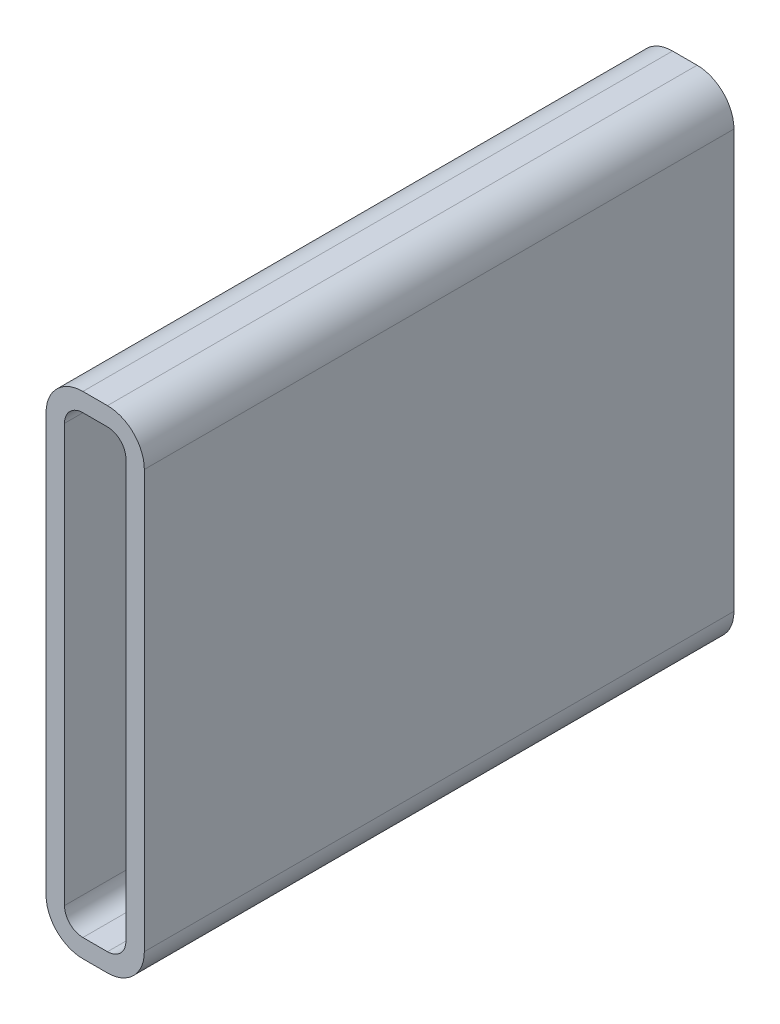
ISO-10303-21;
HEADER;
FILE_DESCRIPTION(('STEP AP214'),'2;1');
FILE_NAME('part.step','',(''),(''),'','','');
FILE_SCHEMA(('AUTOMOTIVE_DESIGN { 1 0 10303 214 1 1 1 1 }'));
ENDSEC;
DATA;
#1=APPLICATION_CONTEXT('core data for automotive mechanical design processes');
#2=APPLICATION_PROTOCOL_DEFINITION('international standard','automotive_design',2000,#1);
#3=PRODUCT_CONTEXT('',#1,'mechanical');
#4=PRODUCT('Part','Part','',(#3));
#5=PRODUCT_RELATED_PRODUCT_CATEGORY('part','',(#4));
#6=PRODUCT_DEFINITION_FORMATION('','',#4);
#7=PRODUCT_DEFINITION_CONTEXT('part definition',#1,'design');
#8=PRODUCT_DEFINITION('design','',#6,#7);
#9=PRODUCT_DEFINITION_SHAPE('','',#8);
#10=(LENGTH_UNIT() NAMED_UNIT(*) SI_UNIT(.MILLI.,.METRE.));
#11=(NAMED_UNIT(*) PLANE_ANGLE_UNIT() SI_UNIT($,.RADIAN.));
#12=(NAMED_UNIT(*) SI_UNIT($,.STERADIAN.) SOLID_ANGLE_UNIT());
#13=UNCERTAINTY_MEASURE_WITH_UNIT(LENGTH_MEASURE(1.E-05),#10,'distance_accuracy_value','');
#14=(GEOMETRIC_REPRESENTATION_CONTEXT(3) GLOBAL_UNCERTAINTY_ASSIGNED_CONTEXT((#13)) GLOBAL_UNIT_ASSIGNED_CONTEXT((#10,
#11,#12)) REPRESENTATION_CONTEXT('',''));
#15=CARTESIAN_POINT('',(0.,0.,0.));
#16=DIRECTION('',(0.,0.,1.));
#17=DIRECTION('',(1.,0.,0.));
#18=AXIS2_PLACEMENT_3D('',#15,#16,#17);
#19=CARTESIAN_POINT('',(19.05,234.95,304.8));
#20=DIRECTION('',(0.,0.,1.));
#21=DIRECTION('',(1.,0.,0.));
#22=AXIS2_PLACEMENT_3D('',#19,#20,#21);
#23=PLANE('',#22);
#24=CARTESIAN_POINT('',(19.05,234.95,304.8));
#25=DIRECTION('',(0.,0.,1.));
#26=DIRECTION('',(1.,0.,0.));
#27=AXIS2_PLACEMENT_3D('',#24,#25,#26);
#28=CIRCLE('',#27,19.05);
#29=CARTESIAN_POINT('',(19.05,254.,304.8));
#30=VERTEX_POINT('',#29);
#31=CARTESIAN_POINT('',(0.,234.95,304.8));
#32=VERTEX_POINT('',#31);
#33=EDGE_CURVE('E211',#30,#32,#28,.T.);
#34=ORIENTED_EDGE('',*,*,#33,.T.);
#35=DIRECTION('',(0.,-1.,0.));
#36=VECTOR('',#35,1.);
#37=CARTESIAN_POINT('',(0.,19.05,304.8));
#38=LINE('',#37,#36);
#39=CARTESIAN_POINT('',(0.,19.05,304.8));
#40=VERTEX_POINT('',#39);
#41=EDGE_CURVE('E214',#32,#40,#38,.T.);
#42=ORIENTED_EDGE('',*,*,#41,.T.);
#43=CARTESIAN_POINT('',(19.05,19.05,304.8));
#44=DIRECTION('',(0.,0.,1.));
#45=DIRECTION('',(1.,0.,0.));
#46=AXIS2_PLACEMENT_3D('',#43,#44,#45);
#47=CIRCLE('',#46,19.05);
#48=CARTESIAN_POINT('',(19.05,0.,304.8));
#49=VERTEX_POINT('',#48);
#50=EDGE_CURVE('E217',#40,#49,#47,.T.);
#51=ORIENTED_EDGE('',*,*,#50,.T.);
#52=DIRECTION('',(1.,0.,0.));
#53=VECTOR('',#52,1.);
#54=CARTESIAN_POINT('',(31.75,0.,304.8));
#55=LINE('',#54,#53);
#56=CARTESIAN_POINT('',(31.75,0.,304.8));
#57=VERTEX_POINT('',#56);
#58=EDGE_CURVE('E219',#49,#57,#55,.T.);
#59=ORIENTED_EDGE('',*,*,#58,.T.);
#60=CARTESIAN_POINT('',(31.75,19.05,304.8));
#61=DIRECTION('',(0.,0.,1.));
#62=DIRECTION('',(1.,0.,0.));
#63=AXIS2_PLACEMENT_3D('',#60,#61,#62);
#64=CIRCLE('',#63,19.05);
#65=CARTESIAN_POINT('',(50.8,19.05,304.8));
#66=VERTEX_POINT('',#65);
#67=EDGE_CURVE('E221',#57,#66,#64,.T.);
#68=ORIENTED_EDGE('',*,*,#67,.T.);
#69=DIRECTION('',(0.,1.,0.));
#70=VECTOR('',#69,1.);
#71=CARTESIAN_POINT('',(50.8,234.95,304.8));
#72=LINE('',#71,#70);
#73=CARTESIAN_POINT('',(50.8,234.95,304.8));
#74=VERTEX_POINT('',#73);
#75=EDGE_CURVE('E223',#66,#74,#72,.T.);
#76=ORIENTED_EDGE('',*,*,#75,.T.);
#77=CARTESIAN_POINT('',(31.75,234.95,304.8));
#78=DIRECTION('',(0.,0.,1.));
#79=DIRECTION('',(1.,0.,0.));
#80=AXIS2_PLACEMENT_3D('',#77,#78,#79);
#81=CIRCLE('',#80,19.05);
#82=CARTESIAN_POINT('',(31.75,254.,304.8));
#83=VERTEX_POINT('',#82);
#84=EDGE_CURVE('E225',#74,#83,#81,.T.);
#85=ORIENTED_EDGE('',*,*,#84,.T.);
#86=DIRECTION('',(-1.,0.,0.));
#87=VECTOR('',#86,1.);
#88=CARTESIAN_POINT('',(19.05,254.,304.8));
#89=LINE('',#88,#87);
#90=EDGE_CURVE('E227',#83,#30,#89,.T.);
#91=ORIENTED_EDGE('',*,*,#90,.T.);
#92=EDGE_LOOP('',(#34,#42,#51,#59,#68,#76,#85,#91));
#93=FACE_BOUND('',#92,.T.);
#94=DIRECTION('',(0.,-1.,0.));
#95=VECTOR('',#94,1.);
#96=CARTESIAN_POINT('',(9.525,19.05,304.8));
#97=LINE('',#96,#95);
#98=CARTESIAN_POINT('',(9.525,234.95,304.8));
#99=VERTEX_POINT('',#98);
#100=CARTESIAN_POINT('',(9.525,19.05,304.8));
#101=VERTEX_POINT('',#100);
#102=EDGE_CURVE('E154',#99,#101,#97,.T.);
#103=ORIENTED_EDGE('',*,*,#102,.F.);
#104=CARTESIAN_POINT('',(19.05,234.95,304.8));
#105=DIRECTION('',(0.,0.,1.));
#106=DIRECTION('',(1.,0.,0.));
#107=AXIS2_PLACEMENT_3D('',#104,#105,#106);
#108=CIRCLE('',#107,9.52500000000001);
#109=CARTESIAN_POINT('',(19.05,244.475,304.8));
#110=VERTEX_POINT('',#109);
#111=EDGE_CURVE('E146',#110,#99,#108,.T.);
#112=ORIENTED_EDGE('',*,*,#111,.F.);
#113=DIRECTION('',(-1.,0.,0.));
#114=VECTOR('',#113,1.);
#115=CARTESIAN_POINT('',(19.05,244.475,304.8));
#116=LINE('',#115,#114);
#117=CARTESIAN_POINT('',(31.75,244.475,304.8));
#118=VERTEX_POINT('',#117);
#119=EDGE_CURVE('E179',#118,#110,#116,.T.);
#120=ORIENTED_EDGE('',*,*,#119,.F.);
#121=CARTESIAN_POINT('',(31.75,234.95,304.8));
#122=DIRECTION('',(0.,0.,1.));
#123=DIRECTION('',(1.,0.,0.));
#124=AXIS2_PLACEMENT_3D('',#121,#122,#123);
#125=CIRCLE('',#124,9.52500000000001);
#126=CARTESIAN_POINT('',(41.275,234.95,304.8));
#127=VERTEX_POINT('',#126);
#128=EDGE_CURVE('E177',#127,#118,#125,.T.);
#129=ORIENTED_EDGE('',*,*,#128,.F.);
#130=DIRECTION('',(0.,1.,0.));
#131=VECTOR('',#130,1.);
#132=CARTESIAN_POINT('',(41.275,234.95,304.8));
#133=LINE('',#132,#131);
#134=CARTESIAN_POINT('',(41.275,19.05,304.8));
#135=VERTEX_POINT('',#134);
#136=EDGE_CURVE('E175',#135,#127,#133,.T.);
#137=ORIENTED_EDGE('',*,*,#136,.F.);
#138=CARTESIAN_POINT('',(31.75,19.05,304.8));
#139=DIRECTION('',(0.,0.,1.));
#140=DIRECTION('',(1.,0.,0.));
#141=AXIS2_PLACEMENT_3D('',#138,#139,#140);
#142=CIRCLE('',#141,9.525);
#143=CARTESIAN_POINT('',(31.75,9.525,304.8));
#144=VERTEX_POINT('',#143);
#145=EDGE_CURVE('E173',#144,#135,#142,.T.);
#146=ORIENTED_EDGE('',*,*,#145,.F.);
#147=DIRECTION('',(1.,0.,0.));
#148=VECTOR('',#147,1.);
#149=CARTESIAN_POINT('',(31.75,9.525,304.8));
#150=LINE('',#149,#148);
#151=CARTESIAN_POINT('',(19.05,9.525,304.8));
#152=VERTEX_POINT('',#151);
#153=EDGE_CURVE('E169',#152,#144,#150,.T.);
#154=ORIENTED_EDGE('',*,*,#153,.F.);
#155=CARTESIAN_POINT('',(19.05,19.05,304.8));
#156=DIRECTION('',(0.,0.,1.));
#157=DIRECTION('',(1.,0.,0.));
#158=AXIS2_PLACEMENT_3D('',#155,#156,#157);
#159=CIRCLE('',#158,9.525);
#160=EDGE_CURVE('E167',#101,#152,#159,.T.);
#161=ORIENTED_EDGE('',*,*,#160,.F.);
#162=EDGE_LOOP('',(#103,#112,#120,#129,#137,#146,#154,#161));
#163=FACE_BOUND('',#162,.T.);
#164=ADVANCED_FACE('F33',(#93,#163),#23,.T.);
#165=CARTESIAN_POINT('',(19.05,234.95,0.));
#166=DIRECTION('',(0.,0.,1.));
#167=DIRECTION('',(1.,0.,0.));
#168=AXIS2_PLACEMENT_3D('',#165,#166,#167);
#169=PLANE('',#168);
#170=CARTESIAN_POINT('',(19.05,234.95,0.));
#171=DIRECTION('',(0.,0.,1.));
#172=DIRECTION('',(1.,0.,0.));
#173=AXIS2_PLACEMENT_3D('',#170,#171,#172);
#174=CIRCLE('',#173,19.05);
#175=CARTESIAN_POINT('',(19.05,254.,0.));
#176=VERTEX_POINT('',#175);
#177=CARTESIAN_POINT('',(0.,234.95,0.));
#178=VERTEX_POINT('',#177);
#179=EDGE_CURVE('E162',#176,#178,#174,.T.);
#180=ORIENTED_EDGE('',*,*,#179,.F.);
#181=DIRECTION('',(-1.,0.,0.));
#182=VECTOR('',#181,1.);
#183=CARTESIAN_POINT('',(19.05,254.,0.));
#184=LINE('',#183,#182);
#185=CARTESIAN_POINT('',(31.75,254.,0.));
#186=VERTEX_POINT('',#185);
#187=EDGE_CURVE('E215',#186,#176,#184,.T.);
#188=ORIENTED_EDGE('',*,*,#187,.F.);
#189=CARTESIAN_POINT('',(31.75,234.95,0.));
#190=DIRECTION('',(0.,0.,1.));
#191=DIRECTION('',(1.,0.,0.));
#192=AXIS2_PLACEMENT_3D('',#189,#190,#191);
#193=CIRCLE('',#192,19.05);
#194=CARTESIAN_POINT('',(50.8,234.95,0.));
#195=VERTEX_POINT('',#194);
#196=EDGE_CURVE('E242',#195,#186,#193,.T.);
#197=ORIENTED_EDGE('',*,*,#196,.F.);
#198=DIRECTION('',(0.,1.,0.));
#199=VECTOR('',#198,1.);
#200=CARTESIAN_POINT('',(50.8,234.95,0.));
#201=LINE('',#200,#199);
#202=CARTESIAN_POINT('',(50.8,19.05,0.));
#203=VERTEX_POINT('',#202);
#204=EDGE_CURVE('E240',#203,#195,#201,.T.);
#205=ORIENTED_EDGE('',*,*,#204,.F.);
#206=CARTESIAN_POINT('',(31.75,19.05,0.));
#207=DIRECTION('',(0.,0.,1.));
#208=DIRECTION('',(1.,0.,0.));
#209=AXIS2_PLACEMENT_3D('',#206,#207,#208);
#210=CIRCLE('',#209,19.05);
#211=CARTESIAN_POINT('',(31.75,0.,0.));
#212=VERTEX_POINT('',#211);
#213=EDGE_CURVE('E238',#212,#203,#210,.T.);
#214=ORIENTED_EDGE('',*,*,#213,.F.);
#215=DIRECTION('',(1.,0.,0.));
#216=VECTOR('',#215,1.);
#217=CARTESIAN_POINT('',(31.75,0.,0.));
#218=LINE('',#217,#216);
#219=CARTESIAN_POINT('',(19.05,0.,0.));
#220=VERTEX_POINT('',#219);
#221=EDGE_CURVE('E236',#220,#212,#218,.T.);
#222=ORIENTED_EDGE('',*,*,#221,.F.);
#223=CARTESIAN_POINT('',(19.05,19.05,0.));
#224=DIRECTION('',(0.,0.,1.));
#225=DIRECTION('',(1.,0.,0.));
#226=AXIS2_PLACEMENT_3D('',#223,#224,#225);
#227=CIRCLE('',#226,19.05);
#228=CARTESIAN_POINT('',(0.,19.05,0.));
#229=VERTEX_POINT('',#228);
#230=EDGE_CURVE('E234',#229,#220,#227,.T.);
#231=ORIENTED_EDGE('',*,*,#230,.F.);
#232=DIRECTION('',(0.,-1.,0.));
#233=VECTOR('',#232,1.);
#234=CARTESIAN_POINT('',(0.,19.05,0.));
#235=LINE('',#234,#233);
#236=EDGE_CURVE('E232',#178,#229,#235,.T.);
#237=ORIENTED_EDGE('',*,*,#236,.F.);
#238=EDGE_LOOP('',(#180,#188,#197,#205,#214,#222,#231,#237));
#239=FACE_BOUND('',#238,.T.);
#240=CARTESIAN_POINT('',(19.05,234.95,0.));
#241=DIRECTION('',(0.,0.,1.));
#242=DIRECTION('',(1.,0.,0.));
#243=AXIS2_PLACEMENT_3D('',#240,#241,#242);
#244=CIRCLE('',#243,9.52500000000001);
#245=CARTESIAN_POINT('',(19.05,244.475,0.));
#246=VERTEX_POINT('',#245);
#247=CARTESIAN_POINT('',(9.525,234.95,0.));
#248=VERTEX_POINT('',#247);
#249=EDGE_CURVE('E56',#246,#248,#244,.T.);
#250=ORIENTED_EDGE('',*,*,#249,.T.);
#251=DIRECTION('',(0.,-1.,0.));
#252=VECTOR('',#251,1.);
#253=CARTESIAN_POINT('',(9.525,19.05,0.));
#254=LINE('',#253,#252);
#255=CARTESIAN_POINT('',(9.525,19.05,0.));
#256=VERTEX_POINT('',#255);
#257=EDGE_CURVE('E161',#248,#256,#254,.T.);
#258=ORIENTED_EDGE('',*,*,#257,.T.);
#259=CARTESIAN_POINT('',(19.05,19.05,0.));
#260=DIRECTION('',(0.,0.,1.));
#261=DIRECTION('',(1.,0.,0.));
#262=AXIS2_PLACEMENT_3D('',#259,#260,#261);
#263=CIRCLE('',#262,9.525);
#264=CARTESIAN_POINT('',(19.05,9.525,0.));
#265=VERTEX_POINT('',#264);
#266=EDGE_CURVE('E183',#256,#265,#263,.T.);
#267=ORIENTED_EDGE('',*,*,#266,.T.);
#268=DIRECTION('',(1.,0.,0.));
#269=VECTOR('',#268,1.);
#270=CARTESIAN_POINT('',(31.75,9.525,0.));
#271=LINE('',#270,#269);
#272=CARTESIAN_POINT('',(31.75,9.525,0.));
#273=VERTEX_POINT('',#272);
#274=EDGE_CURVE('E186',#265,#273,#271,.T.);
#275=ORIENTED_EDGE('',*,*,#274,.T.);
#276=CARTESIAN_POINT('',(31.75,19.05,0.));
#277=DIRECTION('',(0.,0.,1.));
#278=DIRECTION('',(1.,0.,0.));
#279=AXIS2_PLACEMENT_3D('',#276,#277,#278);
#280=CIRCLE('',#279,9.525);
#281=CARTESIAN_POINT('',(41.275,19.05,0.));
#282=VERTEX_POINT('',#281);
#283=EDGE_CURVE('E189',#273,#282,#280,.T.);
#284=ORIENTED_EDGE('',*,*,#283,.T.);
#285=DIRECTION('',(0.,1.,0.));
#286=VECTOR('',#285,1.);
#287=CARTESIAN_POINT('',(41.275,234.95,0.));
#288=LINE('',#287,#286);
#289=CARTESIAN_POINT('',(41.275,234.95,0.));
#290=VERTEX_POINT('',#289);
#291=EDGE_CURVE('E192',#282,#290,#288,.T.);
#292=ORIENTED_EDGE('',*,*,#291,.T.);
#293=CARTESIAN_POINT('',(31.75,234.95,0.));
#294=DIRECTION('',(0.,0.,1.));
#295=DIRECTION('',(1.,0.,0.));
#296=AXIS2_PLACEMENT_3D('',#293,#294,#295);
#297=CIRCLE('',#296,9.52500000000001);
#298=CARTESIAN_POINT('',(31.75,244.475,0.));
#299=VERTEX_POINT('',#298);
#300=EDGE_CURVE('E195',#290,#299,#297,.T.);
#301=ORIENTED_EDGE('',*,*,#300,.T.);
#302=DIRECTION('',(-1.,0.,0.));
#303=VECTOR('',#302,1.);
#304=CARTESIAN_POINT('',(19.05,244.475,0.));
#305=LINE('',#304,#303);
#306=EDGE_CURVE('E155',#299,#246,#305,.T.);
#307=ORIENTED_EDGE('',*,*,#306,.T.);
#308=EDGE_LOOP('',(#250,#258,#267,#275,#284,#292,#301,#307));
#309=FACE_BOUND('',#308,.T.);
#310=ADVANCED_FACE('F272',(#239,#309),#169,.F.);
#311=CARTESIAN_POINT('',(19.05,234.95,304.8));
#312=DIRECTION('',(0.,0.,-1.));
#313=DIRECTION('',(-1.,0.,0.));
#314=AXIS2_PLACEMENT_3D('',#311,#312,#313);
#315=CYLINDRICAL_SURFACE('',#314,19.05);
#316=ORIENTED_EDGE('',*,*,#179,.T.);
#317=DIRECTION('',(0.,0.,-1.));
#318=VECTOR('',#317,1.);
#319=CARTESIAN_POINT('',(0.,234.95,304.8));
#320=LINE('',#319,#318);
#321=EDGE_CURVE('E11',#32,#178,#320,.T.);
#322=ORIENTED_EDGE('',*,*,#321,.F.);
#323=ORIENTED_EDGE('',*,*,#33,.F.);
#324=DIRECTION('',(0.,0.,-1.));
#325=VECTOR('',#324,1.);
#326=CARTESIAN_POINT('',(19.05,254.,304.8));
#327=LINE('',#326,#325);
#328=EDGE_CURVE('E229',#30,#176,#327,.T.);
#329=ORIENTED_EDGE('',*,*,#328,.T.);
#330=EDGE_LOOP('',(#316,#322,#323,#329));
#331=FACE_BOUND('',#330,.T.);
#332=ADVANCED_FACE('F35',(#331),#315,.T.);
#333=CARTESIAN_POINT('',(0.,19.05,304.8));
#334=DIRECTION('',(1.,0.,0.));
#335=DIRECTION('',(0.,0.,-1.));
#336=AXIS2_PLACEMENT_3D('',#333,#334,#335);
#337=PLANE('',#336);
#338=ORIENTED_EDGE('',*,*,#236,.T.);
#339=DIRECTION('',(0.,0.,-1.));
#340=VECTOR('',#339,1.);
#341=CARTESIAN_POINT('',(0.,19.05,304.8));
#342=LINE('',#341,#340);
#343=EDGE_CURVE('E41',#40,#229,#342,.T.);
#344=ORIENTED_EDGE('',*,*,#343,.F.);
#345=ORIENTED_EDGE('',*,*,#41,.F.);
#346=ORIENTED_EDGE('',*,*,#321,.T.);
#347=EDGE_LOOP('',(#338,#344,#345,#346));
#348=FACE_BOUND('',#347,.T.);
#349=ADVANCED_FACE('F289',(#348),#337,.F.);
#350=CARTESIAN_POINT('',(19.05,19.05,304.8));
#351=DIRECTION('',(0.,0.,-1.));
#352=DIRECTION('',(-1.,0.,0.));
#353=AXIS2_PLACEMENT_3D('',#350,#351,#352);
#354=CYLINDRICAL_SURFACE('',#353,19.05);
#355=ORIENTED_EDGE('',*,*,#230,.T.);
#356=DIRECTION('',(0.,0.,-1.));
#357=VECTOR('',#356,1.);
#358=CARTESIAN_POINT('',(19.05,0.,304.8));
#359=LINE('',#358,#357);
#360=EDGE_CURVE('E259',#49,#220,#359,.T.);
#361=ORIENTED_EDGE('',*,*,#360,.F.);
#362=ORIENTED_EDGE('',*,*,#50,.F.);
#363=ORIENTED_EDGE('',*,*,#343,.T.);
#364=EDGE_LOOP('',(#355,#361,#362,#363));
#365=FACE_BOUND('',#364,.T.);
#366=ADVANCED_FACE('F266',(#365),#354,.T.);
#367=CARTESIAN_POINT('',(31.75,0.,304.8));
#368=DIRECTION('',(0.,1.,0.));
#369=DIRECTION('',(0.,0.,1.));
#370=AXIS2_PLACEMENT_3D('',#367,#368,#369);
#371=PLANE('',#370);
#372=ORIENTED_EDGE('',*,*,#221,.T.);
#373=DIRECTION('',(0.,0.,-1.));
#374=VECTOR('',#373,1.);
#375=CARTESIAN_POINT('',(31.75,0.,304.8));
#376=LINE('',#375,#374);
#377=EDGE_CURVE('E256',#57,#212,#376,.T.);
#378=ORIENTED_EDGE('',*,*,#377,.F.);
#379=ORIENTED_EDGE('',*,*,#58,.F.);
#380=ORIENTED_EDGE('',*,*,#360,.T.);
#381=EDGE_LOOP('',(#372,#378,#379,#380));
#382=FACE_BOUND('',#381,.T.);
#383=ADVANCED_FACE('F278',(#382),#371,.F.);
#384=CARTESIAN_POINT('',(31.75,19.05,304.8));
#385=DIRECTION('',(0.,0.,-1.));
#386=DIRECTION('',(-1.,0.,0.));
#387=AXIS2_PLACEMENT_3D('',#384,#385,#386);
#388=CYLINDRICAL_SURFACE('',#387,19.05);
#389=ORIENTED_EDGE('',*,*,#213,.T.);
#390=DIRECTION('',(0.,0.,-1.));
#391=VECTOR('',#390,1.);
#392=CARTESIAN_POINT('',(50.8,19.05,304.8));
#393=LINE('',#392,#391);
#394=EDGE_CURVE('E253',#66,#203,#393,.T.);
#395=ORIENTED_EDGE('',*,*,#394,.F.);
#396=ORIENTED_EDGE('',*,*,#67,.F.);
#397=ORIENTED_EDGE('',*,*,#377,.T.);
#398=EDGE_LOOP('',(#389,#395,#396,#397));
#399=FACE_BOUND('',#398,.T.);
#400=ADVANCED_FACE('F282',(#399),#388,.T.);
#401=CARTESIAN_POINT('',(50.8,234.95,304.8));
#402=DIRECTION('',(-1.,0.,0.));
#403=DIRECTION('',(0.,0.,1.));
#404=AXIS2_PLACEMENT_3D('',#401,#402,#403);
#405=PLANE('',#404);
#406=ORIENTED_EDGE('',*,*,#204,.T.);
#407=DIRECTION('',(0.,0.,-1.));
#408=VECTOR('',#407,1.);
#409=CARTESIAN_POINT('',(50.8,234.95,304.8));
#410=LINE('',#409,#408);
#411=EDGE_CURVE('E250',#74,#195,#410,.T.);
#412=ORIENTED_EDGE('',*,*,#411,.F.);
#413=ORIENTED_EDGE('',*,*,#75,.F.);
#414=ORIENTED_EDGE('',*,*,#394,.T.);
#415=EDGE_LOOP('',(#406,#412,#413,#414));
#416=FACE_BOUND('',#415,.T.);
#417=ADVANCED_FACE('F302',(#416),#405,.F.);
#418=CARTESIAN_POINT('',(31.75,234.95,304.8));
#419=DIRECTION('',(0.,0.,-1.));
#420=DIRECTION('',(-1.,0.,0.));
#421=AXIS2_PLACEMENT_3D('',#418,#419,#420);
#422=CYLINDRICAL_SURFACE('',#421,19.05);
#423=ORIENTED_EDGE('',*,*,#196,.T.);
#424=DIRECTION('',(0.,0.,-1.));
#425=VECTOR('',#424,1.);
#426=CARTESIAN_POINT('',(31.75,254.,304.8));
#427=LINE('',#426,#425);
#428=EDGE_CURVE('E247',#83,#186,#427,.T.);
#429=ORIENTED_EDGE('',*,*,#428,.F.);
#430=ORIENTED_EDGE('',*,*,#84,.F.);
#431=ORIENTED_EDGE('',*,*,#411,.T.);
#432=EDGE_LOOP('',(#423,#429,#430,#431));
#433=FACE_BOUND('',#432,.T.);
#434=ADVANCED_FACE('F300',(#433),#422,.T.);
#435=CARTESIAN_POINT('',(19.05,254.,304.8));
#436=DIRECTION('',(0.,-1.,0.));
#437=DIRECTION('',(0.,0.,-1.));
#438=AXIS2_PLACEMENT_3D('',#435,#436,#437);
#439=PLANE('',#438);
#440=ORIENTED_EDGE('',*,*,#187,.T.);
#441=ORIENTED_EDGE('',*,*,#328,.F.);
#442=ORIENTED_EDGE('',*,*,#90,.F.);
#443=ORIENTED_EDGE('',*,*,#428,.T.);
#444=EDGE_LOOP('',(#440,#441,#442,#443));
#445=FACE_BOUND('',#444,.T.);
#446=ADVANCED_FACE('F295',(#445),#439,.F.);
#447=CARTESIAN_POINT('',(19.05,234.95,304.8));
#448=DIRECTION('',(0.,0.,-1.));
#449=DIRECTION('',(-1.,0.,0.));
#450=AXIS2_PLACEMENT_3D('',#447,#448,#449);
#451=CYLINDRICAL_SURFACE('',#450,9.52500000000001);
#452=ORIENTED_EDGE('',*,*,#249,.F.);
#453=DIRECTION('',(0.,0.,-1.));
#454=VECTOR('',#453,1.);
#455=CARTESIAN_POINT('',(19.05,244.475,304.8));
#456=LINE('',#455,#454);
#457=EDGE_CURVE('E150',#110,#246,#456,.T.);
#458=ORIENTED_EDGE('',*,*,#457,.F.);
#459=ORIENTED_EDGE('',*,*,#111,.T.);
#460=DIRECTION('',(0.,0.,-1.));
#461=VECTOR('',#460,1.);
#462=CARTESIAN_POINT('',(9.525,234.95,304.8));
#463=LINE('',#462,#461);
#464=EDGE_CURVE('E149',#99,#248,#463,.T.);
#465=ORIENTED_EDGE('',*,*,#464,.T.);
#466=EDGE_LOOP('',(#452,#458,#459,#465));
#467=FACE_BOUND('',#466,.T.);
#468=ADVANCED_FACE('F148',(#467),#451,.F.);
#469=CARTESIAN_POINT('',(9.525,19.05,304.8));
#470=DIRECTION('',(1.,0.,0.));
#471=DIRECTION('',(0.,0.,-1.));
#472=AXIS2_PLACEMENT_3D('',#469,#470,#471);
#473=PLANE('',#472);
#474=ORIENTED_EDGE('',*,*,#257,.F.);
#475=ORIENTED_EDGE('',*,*,#464,.F.);
#476=ORIENTED_EDGE('',*,*,#102,.T.);
#477=DIRECTION('',(0.,0.,-1.));
#478=VECTOR('',#477,1.);
#479=CARTESIAN_POINT('',(9.525,19.05,304.8));
#480=LINE('',#479,#478);
#481=EDGE_CURVE('E163',#101,#256,#480,.T.);
#482=ORIENTED_EDGE('',*,*,#481,.T.);
#483=EDGE_LOOP('',(#474,#475,#476,#482));
#484=FACE_BOUND('',#483,.T.);
#485=ADVANCED_FACE('F158',(#484),#473,.T.);
#486=CARTESIAN_POINT('',(19.05,19.05,304.8));
#487=DIRECTION('',(0.,0.,-1.));
#488=DIRECTION('',(-1.,0.,0.));
#489=AXIS2_PLACEMENT_3D('',#486,#487,#488);
#490=CYLINDRICAL_SURFACE('',#489,9.525);
#491=ORIENTED_EDGE('',*,*,#266,.F.);
#492=ORIENTED_EDGE('',*,*,#481,.F.);
#493=ORIENTED_EDGE('',*,*,#160,.T.);
#494=DIRECTION('',(0.,0.,-1.));
#495=VECTOR('',#494,1.);
#496=CARTESIAN_POINT('',(19.05,9.525,304.8));
#497=LINE('',#496,#495);
#498=EDGE_CURVE('E208',#152,#265,#497,.T.);
#499=ORIENTED_EDGE('',*,*,#498,.T.);
#500=EDGE_LOOP('',(#491,#492,#493,#499));
#501=FACE_BOUND('',#500,.T.);
#502=ADVANCED_FACE('F327',(#501),#490,.F.);
#503=CARTESIAN_POINT('',(31.75,9.525,304.8));
#504=DIRECTION('',(0.,1.,0.));
#505=DIRECTION('',(0.,0.,1.));
#506=AXIS2_PLACEMENT_3D('',#503,#504,#505);
#507=PLANE('',#506);
#508=ORIENTED_EDGE('',*,*,#274,.F.);
#509=ORIENTED_EDGE('',*,*,#498,.F.);
#510=ORIENTED_EDGE('',*,*,#153,.T.);
#511=DIRECTION('',(0.,0.,-1.));
#512=VECTOR('',#511,1.);
#513=CARTESIAN_POINT('',(31.75,9.525,304.8));
#514=LINE('',#513,#512);
#515=EDGE_CURVE('E206',#144,#273,#514,.T.);
#516=ORIENTED_EDGE('',*,*,#515,.T.);
#517=EDGE_LOOP('',(#508,#509,#510,#516));
#518=FACE_BOUND('',#517,.T.);
#519=ADVANCED_FACE('F331',(#518),#507,.T.);
#520=CARTESIAN_POINT('',(31.75,19.05,304.8));
#521=DIRECTION('',(0.,0.,-1.));
#522=DIRECTION('',(-1.,0.,0.));
#523=AXIS2_PLACEMENT_3D('',#520,#521,#522);
#524=CYLINDRICAL_SURFACE('',#523,9.525);
#525=ORIENTED_EDGE('',*,*,#283,.F.);
#526=ORIENTED_EDGE('',*,*,#515,.F.);
#527=ORIENTED_EDGE('',*,*,#145,.T.);
#528=DIRECTION('',(0.,0.,-1.));
#529=VECTOR('',#528,1.);
#530=CARTESIAN_POINT('',(41.275,19.05,304.8));
#531=LINE('',#530,#529);
#532=EDGE_CURVE('E204',#135,#282,#531,.T.);
#533=ORIENTED_EDGE('',*,*,#532,.T.);
#534=EDGE_LOOP('',(#525,#526,#527,#533));
#535=FACE_BOUND('',#534,.T.);
#536=ADVANCED_FACE('F337',(#535),#524,.F.);
#537=CARTESIAN_POINT('',(41.275,234.95,304.8));
#538=DIRECTION('',(-1.,0.,0.));
#539=DIRECTION('',(0.,0.,1.));
#540=AXIS2_PLACEMENT_3D('',#537,#538,#539);
#541=PLANE('',#540);
#542=ORIENTED_EDGE('',*,*,#291,.F.);
#543=ORIENTED_EDGE('',*,*,#532,.F.);
#544=ORIENTED_EDGE('',*,*,#136,.T.);
#545=DIRECTION('',(0.,0.,-1.));
#546=VECTOR('',#545,1.);
#547=CARTESIAN_POINT('',(41.275,234.95,304.8));
#548=LINE('',#547,#546);
#549=EDGE_CURVE('E202',#127,#290,#548,.T.);
#550=ORIENTED_EDGE('',*,*,#549,.T.);
#551=EDGE_LOOP('',(#542,#543,#544,#550));
#552=FACE_BOUND('',#551,.T.);
#553=ADVANCED_FACE('F341',(#552),#541,.T.);
#554=CARTESIAN_POINT('',(31.75,234.95,304.8));
#555=DIRECTION('',(0.,0.,-1.));
#556=DIRECTION('',(-1.,0.,0.));
#557=AXIS2_PLACEMENT_3D('',#554,#555,#556);
#558=CYLINDRICAL_SURFACE('',#557,9.52500000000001);
#559=ORIENTED_EDGE('',*,*,#300,.F.);
#560=ORIENTED_EDGE('',*,*,#549,.F.);
#561=ORIENTED_EDGE('',*,*,#128,.T.);
#562=DIRECTION('',(0.,0.,-1.));
#563=VECTOR('',#562,1.);
#564=CARTESIAN_POINT('',(31.75,244.475,304.8));
#565=LINE('',#564,#563);
#566=EDGE_CURVE('E48',#118,#299,#565,.T.);
#567=ORIENTED_EDGE('',*,*,#566,.T.);
#568=EDGE_LOOP('',(#559,#560,#561,#567));
#569=FACE_BOUND('',#568,.T.);
#570=ADVANCED_FACE('F345',(#569),#558,.F.);
#571=CARTESIAN_POINT('',(19.05,244.475,304.8));
#572=DIRECTION('',(0.,-1.,0.));
#573=DIRECTION('',(0.,0.,-1.));
#574=AXIS2_PLACEMENT_3D('',#571,#572,#573);
#575=PLANE('',#574);
#576=ORIENTED_EDGE('',*,*,#306,.F.);
#577=ORIENTED_EDGE('',*,*,#566,.F.);
#578=ORIENTED_EDGE('',*,*,#119,.T.);
#579=ORIENTED_EDGE('',*,*,#457,.T.);
#580=EDGE_LOOP('',(#576,#577,#578,#579));
#581=FACE_BOUND('',#580,.T.);
#582=ADVANCED_FACE('F349',(#581),#575,.T.);
#583=CLOSED_SHELL('',(#164,#310,#332,#349,#366,#383,#400,#417,#434,#446,#468,#485,#502,#519,
#536,#553,#570,#582));
#584=MANIFOLD_SOLID_BREP('B2',#583);
#585=ADVANCED_BREP_SHAPE_REPRESENTATION('',(#18,#584),#14);
#586=SHAPE_DEFINITION_REPRESENTATION(#9,#585);
ENDSEC;
END-ISO-10303-21;
